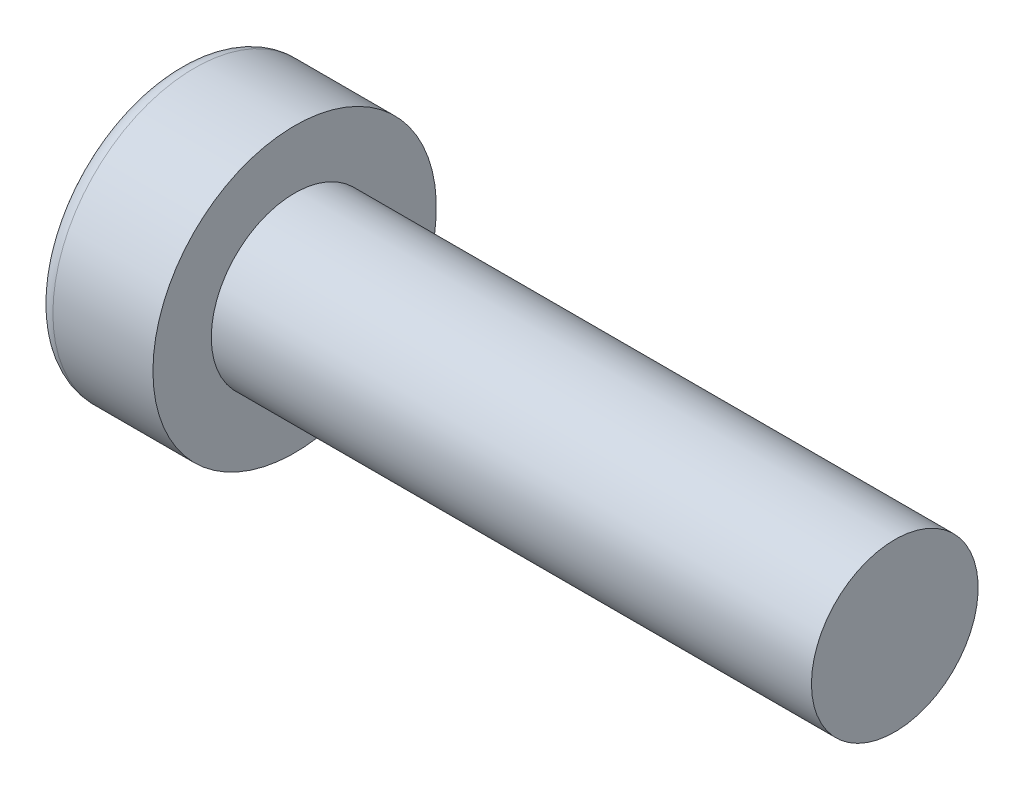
ISO-10303-21;
HEADER;
FILE_DESCRIPTION(('STEP AP214'),'2;1');
FILE_NAME('part.step','',(''),(''),'','','');
FILE_SCHEMA(('AUTOMOTIVE_DESIGN { 1 0 10303 214 1 1 1 1 }'));
ENDSEC;
DATA;
#1=APPLICATION_CONTEXT('core data for automotive mechanical design processes');
#2=APPLICATION_PROTOCOL_DEFINITION('international standard','automotive_design',2000,#1);
#3=PRODUCT_CONTEXT('',#1,'mechanical');
#4=PRODUCT('Part','Part','',(#3));
#5=PRODUCT_RELATED_PRODUCT_CATEGORY('part','',(#4));
#6=PRODUCT_DEFINITION_FORMATION('','',#4);
#7=PRODUCT_DEFINITION_CONTEXT('part definition',#1,'design');
#8=PRODUCT_DEFINITION('design','',#6,#7);
#9=PRODUCT_DEFINITION_SHAPE('','',#8);
#10=(LENGTH_UNIT() NAMED_UNIT(*) SI_UNIT(.MILLI.,.METRE.));
#11=(NAMED_UNIT(*) PLANE_ANGLE_UNIT() SI_UNIT($,.RADIAN.));
#12=(NAMED_UNIT(*) SI_UNIT($,.STERADIAN.) SOLID_ANGLE_UNIT());
#13=UNCERTAINTY_MEASURE_WITH_UNIT(LENGTH_MEASURE(1.E-05),#10,'distance_accuracy_value','');
#14=(GEOMETRIC_REPRESENTATION_CONTEXT(3) GLOBAL_UNCERTAINTY_ASSIGNED_CONTEXT((#13)) GLOBAL_UNIT_ASSIGNED_CONTEXT((#10,
#11,#12)) REPRESENTATION_CONTEXT('',''));
#15=CARTESIAN_POINT('',(0.,0.,0.));
#16=DIRECTION('',(0.,0.,1.));
#17=DIRECTION('',(1.,0.,0.));
#18=AXIS2_PLACEMENT_3D('',#15,#16,#17);
#19=CARTESIAN_POINT('',(-18.,4.25,0.));
#20=DIRECTION('',(-1.,0.,0.));
#21=DIRECTION('',(0.,0.,1.));
#22=AXIS2_PLACEMENT_3D('',#19,#20,#21);
#23=PLANE('',#22);
#24=CARTESIAN_POINT('',(-18.,0.,0.));
#25=DIRECTION('',(-1.,0.,0.));
#26=DIRECTION('',(0.,0.,1.));
#27=AXIS2_PLACEMENT_3D('',#24,#25,#26);
#28=CIRCLE('',#27,4.25);
#29=CARTESIAN_POINT('',(-18.,0.,4.25));
#30=VERTEX_POINT('',#29);
#31=EDGE_CURVE('E148',#30,#30,#28,.T.);
#32=ORIENTED_EDGE('',*,*,#31,.F.);
#33=EDGE_LOOP('',(#32));
#34=FACE_BOUND('',#33,.T.);
#35=CARTESIAN_POINT('',(-18.,0.,0.));
#36=DIRECTION('',(-1.,0.,0.));
#37=DIRECTION('',(0.,0.,1.));
#38=AXIS2_PLACEMENT_3D('',#35,#36,#37);
#39=CIRCLE('',#38,2.5);
#40=CARTESIAN_POINT('',(-18.,0.,2.5));
#41=VERTEX_POINT('',#40);
#42=EDGE_CURVE('E137',#41,#41,#39,.T.);
#43=ORIENTED_EDGE('',*,*,#42,.T.);
#44=EDGE_LOOP('',(#43));
#45=FACE_BOUND('',#44,.T.);
#46=ADVANCED_FACE('F35',(#34,#45),#23,.F.);
#47=CARTESIAN_POINT('',(-65.0118083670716,0.,0.));
#48=DIRECTION('',(-1.,0.,0.));
#49=DIRECTION('',(0.,0.,1.));
#50=AXIS2_PLACEMENT_3D('',#47,#48,#49);
#51=CYLINDRICAL_SURFACE('',#50,4.25);
#52=CARTESIAN_POINT('',(-21.,0.,0.));
#53=DIRECTION('',(1.,0.,0.));
#54=DIRECTION('',(0.,0.,-1.));
#55=AXIS2_PLACEMENT_3D('',#52,#53,#54);
#56=CIRCLE('',#55,4.25);
#57=CARTESIAN_POINT('',(-21.,0.,-4.25));
#58=VERTEX_POINT('',#57);
#59=EDGE_CURVE('E11',#58,#58,#56,.T.);
#60=ORIENTED_EDGE('',*,*,#59,.T.);
#61=EDGE_LOOP('',(#60));
#62=FACE_BOUND('',#61,.T.);
#63=ORIENTED_EDGE('',*,*,#31,.T.);
#64=EDGE_LOOP('',(#63));
#65=FACE_BOUND('',#64,.T.);
#66=ADVANCED_FACE('F170',(#62,#65),#51,.T.);
#67=CARTESIAN_POINT('',(-21.5,0.,0.));
#68=DIRECTION('',(1.,0.,0.));
#69=DIRECTION('',(0.,0.,-1.));
#70=AXIS2_PLACEMENT_3D('',#67,#68,#69);
#71=PLANE('',#70);
#72=DIRECTION('',(0.,0.5,-0.866025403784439));
#73=VECTOR('',#72,1.);
#74=CARTESIAN_POINT('',(-21.5,1.15470053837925,2.));
#75=LINE('',#74,#73);
#76=CARTESIAN_POINT('',(-21.5,1.15470053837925,2.));
#77=VERTEX_POINT('',#76);
#78=CARTESIAN_POINT('',(-21.5,2.3094010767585,0.));
#79=VERTEX_POINT('',#78);
#80=EDGE_CURVE('E124',#77,#79,#75,.T.);
#81=ORIENTED_EDGE('',*,*,#80,.F.);
#82=DIRECTION('',(0.,1.,0.));
#83=VECTOR('',#82,1.);
#84=CARTESIAN_POINT('',(-21.5,-1.15470053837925,2.));
#85=LINE('',#84,#83);
#86=CARTESIAN_POINT('',(-21.5,-1.15470053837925,2.));
#87=VERTEX_POINT('',#86);
#88=EDGE_CURVE('E50',#87,#77,#85,.T.);
#89=ORIENTED_EDGE('',*,*,#88,.F.);
#90=DIRECTION('',(0.,0.5,0.866025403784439));
#91=VECTOR('',#90,1.);
#92=CARTESIAN_POINT('',(-21.5,-2.3094010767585,0.));
#93=LINE('',#92,#91);
#94=CARTESIAN_POINT('',(-21.5,-2.3094010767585,0.));
#95=VERTEX_POINT('',#94);
#96=EDGE_CURVE('E133',#95,#87,#93,.T.);
#97=ORIENTED_EDGE('',*,*,#96,.F.);
#98=DIRECTION('',(0.,-0.5,0.866025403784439));
#99=VECTOR('',#98,1.);
#100=CARTESIAN_POINT('',(-21.5,-1.15470053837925,-2.));
#101=LINE('',#100,#99);
#102=CARTESIAN_POINT('',(-21.5,-1.15470053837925,-2.));
#103=VERTEX_POINT('',#102);
#104=EDGE_CURVE('E131',#103,#95,#101,.T.);
#105=ORIENTED_EDGE('',*,*,#104,.F.);
#106=DIRECTION('',(0.,-1.,0.));
#107=VECTOR('',#106,1.);
#108=CARTESIAN_POINT('',(-21.5,1.15470053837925,-2.));
#109=LINE('',#108,#107);
#110=CARTESIAN_POINT('',(-21.5,1.15470053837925,-2.));
#111=VERTEX_POINT('',#110);
#112=EDGE_CURVE('E98',#111,#103,#109,.T.);
#113=ORIENTED_EDGE('',*,*,#112,.F.);
#114=DIRECTION('',(0.,-0.5,-0.866025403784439));
#115=VECTOR('',#114,1.);
#116=CARTESIAN_POINT('',(-21.5,2.3094010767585,0.));
#117=LINE('',#116,#115);
#118=EDGE_CURVE('E127',#79,#111,#117,.T.);
#119=ORIENTED_EDGE('',*,*,#118,.F.);
#120=EDGE_LOOP('',(#81,#89,#97,#105,#113,#119));
#121=FACE_BOUND('',#120,.T.);
#122=CARTESIAN_POINT('',(-21.5,0.,0.));
#123=DIRECTION('',(1.,0.,0.));
#124=DIRECTION('',(0.,0.,-1.));
#125=AXIS2_PLACEMENT_3D('',#122,#123,#124);
#126=CIRCLE('',#125,3.75);
#127=CARTESIAN_POINT('',(-21.5,0.,-3.75));
#128=VERTEX_POINT('',#127);
#129=EDGE_CURVE('E43',#128,#128,#126,.F.);
#130=ORIENTED_EDGE('',*,*,#129,.T.);
#131=EDGE_LOOP('',(#130));
#132=FACE_BOUND('',#131,.T.);
#133=ADVANCED_FACE('F153',(#121,#132),#71,.F.);
#134=CARTESIAN_POINT('',(0.,2.5,0.));
#135=DIRECTION('',(-1.,0.,0.));
#136=DIRECTION('',(0.,0.,1.));
#137=AXIS2_PLACEMENT_3D('',#134,#135,#136);
#138=PLANE('',#137);
#139=CARTESIAN_POINT('',(0.,0.,0.));
#140=DIRECTION('',(-1.,0.,0.));
#141=DIRECTION('',(0.,0.,1.));
#142=AXIS2_PLACEMENT_3D('',#139,#140,#141);
#143=CIRCLE('',#142,2.5);
#144=CARTESIAN_POINT('',(0.,0.,2.5));
#145=VERTEX_POINT('',#144);
#146=EDGE_CURVE('E145',#145,#145,#143,.T.);
#147=ORIENTED_EDGE('',*,*,#146,.F.);
#148=EDGE_LOOP('',(#147));
#149=FACE_BOUND('',#148,.T.);
#150=ADVANCED_FACE('F165',(#149),#138,.F.);
#151=CARTESIAN_POINT('',(-65.0118083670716,0.,0.));
#152=DIRECTION('',(-1.,0.,0.));
#153=DIRECTION('',(0.,0.,1.));
#154=AXIS2_PLACEMENT_3D('',#151,#152,#153);
#155=CYLINDRICAL_SURFACE('',#154,2.5);
#156=ORIENTED_EDGE('',*,*,#42,.F.);
#157=EDGE_LOOP('',(#156));
#158=FACE_BOUND('',#157,.T.);
#159=ORIENTED_EDGE('',*,*,#146,.T.);
#160=EDGE_LOOP('',(#159));
#161=FACE_BOUND('',#160,.T.);
#162=ADVANCED_FACE('F157',(#158,#161),#155,.T.);
#163=CARTESIAN_POINT('',(-21.,0.,0.));
#164=DIRECTION('',(1.,0.,0.));
#165=DIRECTION('',(0.,0.,-1.));
#166=AXIS2_PLACEMENT_3D('',#163,#164,#165);
#167=TOROIDAL_SURFACE('',#166,3.75,0.5);
#168=ORIENTED_EDGE('',*,*,#59,.F.);
#169=EDGE_LOOP('',(#168));
#170=FACE_BOUND('',#169,.T.);
#171=ORIENTED_EDGE('',*,*,#129,.F.);
#172=EDGE_LOOP('',(#171));
#173=FACE_BOUND('',#172,.T.);
#174=ADVANCED_FACE('F37',(#170,#173),#167,.T.);
#175=CARTESIAN_POINT('',(-18.5,-1.15470053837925,2.));
#176=DIRECTION('',(0.,0.,1.));
#177=DIRECTION('',(1.,0.,0.));
#178=AXIS2_PLACEMENT_3D('',#175,#176,#177);
#179=PLANE('',#178);
#180=ORIENTED_EDGE('',*,*,#88,.T.);
#181=DIRECTION('',(-1.,0.,0.));
#182=VECTOR('',#181,1.);
#183=CARTESIAN_POINT('',(-18.5,1.15470053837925,2.));
#184=LINE('',#183,#182);
#185=CARTESIAN_POINT('',(-18.5,1.15470053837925,2.));
#186=VERTEX_POINT('',#185);
#187=EDGE_CURVE('E80',#186,#77,#184,.T.);
#188=ORIENTED_EDGE('',*,*,#187,.F.);
#189=DIRECTION('',(0.,1.,0.));
#190=VECTOR('',#189,1.);
#191=CARTESIAN_POINT('',(-18.5,-1.15470053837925,2.));
#192=LINE('',#191,#190);
#193=CARTESIAN_POINT('',(-18.5,-1.15470053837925,2.));
#194=VERTEX_POINT('',#193);
#195=EDGE_CURVE('E135',#194,#186,#192,.T.);
#196=ORIENTED_EDGE('',*,*,#195,.F.);
#197=DIRECTION('',(-1.,0.,0.));
#198=VECTOR('',#197,1.);
#199=CARTESIAN_POINT('',(-18.5,-1.15470053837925,2.));
#200=LINE('',#199,#198);
#201=EDGE_CURVE('E58',#194,#87,#200,.T.);
#202=ORIENTED_EDGE('',*,*,#201,.T.);
#203=EDGE_LOOP('',(#180,#188,#196,#202));
#204=FACE_BOUND('',#203,.T.);
#205=ADVANCED_FACE('F156',(#204),#179,.F.);
#206=CARTESIAN_POINT('',(-18.5,-2.3094010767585,0.));
#207=DIRECTION('',(0.,-0.866025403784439,0.5));
#208=DIRECTION('',(0.,-0.5,-0.866025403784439));
#209=AXIS2_PLACEMENT_3D('',#206,#207,#208);
#210=PLANE('',#209);
#211=ORIENTED_EDGE('',*,*,#96,.T.);
#212=ORIENTED_EDGE('',*,*,#201,.F.);
#213=DIRECTION('',(0.,0.5,0.866025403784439));
#214=VECTOR('',#213,1.);
#215=CARTESIAN_POINT('',(-18.5,-2.3094010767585,0.));
#216=LINE('',#215,#214);
#217=CARTESIAN_POINT('',(-18.5,-2.3094010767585,0.));
#218=VERTEX_POINT('',#217);
#219=EDGE_CURVE('E110',#218,#194,#216,.T.);
#220=ORIENTED_EDGE('',*,*,#219,.F.);
#221=DIRECTION('',(-1.,0.,0.));
#222=VECTOR('',#221,1.);
#223=CARTESIAN_POINT('',(-18.5,-2.3094010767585,0.));
#224=LINE('',#223,#222);
#225=EDGE_CURVE('E102',#218,#95,#224,.T.);
#226=ORIENTED_EDGE('',*,*,#225,.T.);
#227=EDGE_LOOP('',(#211,#212,#220,#226));
#228=FACE_BOUND('',#227,.T.);
#229=ADVANCED_FACE('F163',(#228),#210,.F.);
#230=CARTESIAN_POINT('',(-18.5,-1.15470053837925,-2.));
#231=DIRECTION('',(0.,-0.866025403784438,-0.5));
#232=DIRECTION('',(0.,0.5,-0.866025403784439));
#233=AXIS2_PLACEMENT_3D('',#230,#231,#232);
#234=PLANE('',#233);
#235=ORIENTED_EDGE('',*,*,#104,.T.);
#236=ORIENTED_EDGE('',*,*,#225,.F.);
#237=DIRECTION('',(0.,-0.5,0.866025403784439));
#238=VECTOR('',#237,1.);
#239=CARTESIAN_POINT('',(-18.5,-1.15470053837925,-2.));
#240=LINE('',#239,#238);
#241=CARTESIAN_POINT('',(-18.5,-1.15470053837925,-2.));
#242=VERTEX_POINT('',#241);
#243=EDGE_CURVE('E106',#242,#218,#240,.T.);
#244=ORIENTED_EDGE('',*,*,#243,.F.);
#245=DIRECTION('',(-1.,0.,0.));
#246=VECTOR('',#245,1.);
#247=CARTESIAN_POINT('',(-18.5,-1.15470053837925,-2.));
#248=LINE('',#247,#246);
#249=EDGE_CURVE('E91',#242,#103,#248,.T.);
#250=ORIENTED_EDGE('',*,*,#249,.T.);
#251=EDGE_LOOP('',(#235,#236,#244,#250));
#252=FACE_BOUND('',#251,.T.);
#253=ADVANCED_FACE('F107',(#252),#234,.F.);
#254=CARTESIAN_POINT('',(-18.5,1.15470053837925,-2.));
#255=DIRECTION('',(0.,0.,-1.));
#256=DIRECTION('',(0.,1.,0.));
#257=AXIS2_PLACEMENT_3D('',#254,#255,#256);
#258=PLANE('',#257);
#259=ORIENTED_EDGE('',*,*,#112,.T.);
#260=ORIENTED_EDGE('',*,*,#249,.F.);
#261=DIRECTION('',(0.,-1.,0.));
#262=VECTOR('',#261,1.);
#263=CARTESIAN_POINT('',(-18.5,1.15470053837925,-2.));
#264=LINE('',#263,#262);
#265=CARTESIAN_POINT('',(-18.5,1.15470053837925,-2.));
#266=VERTEX_POINT('',#265);
#267=EDGE_CURVE('E95',#266,#242,#264,.T.);
#268=ORIENTED_EDGE('',*,*,#267,.F.);
#269=DIRECTION('',(-1.,0.,0.));
#270=VECTOR('',#269,1.);
#271=CARTESIAN_POINT('',(-18.5,1.15470053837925,-2.));
#272=LINE('',#271,#270);
#273=EDGE_CURVE('E103',#266,#111,#272,.T.);
#274=ORIENTED_EDGE('',*,*,#273,.T.);
#275=EDGE_LOOP('',(#259,#260,#268,#274));
#276=FACE_BOUND('',#275,.T.);
#277=ADVANCED_FACE('F93',(#276),#258,.F.);
#278=CARTESIAN_POINT('',(-18.5,2.3094010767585,0.));
#279=DIRECTION('',(0.,0.866025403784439,-0.5));
#280=DIRECTION('',(0.,0.5,0.866025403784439));
#281=AXIS2_PLACEMENT_3D('',#278,#279,#280);
#282=PLANE('',#281);
#283=ORIENTED_EDGE('',*,*,#118,.T.);
#284=ORIENTED_EDGE('',*,*,#273,.F.);
#285=DIRECTION('',(0.,-0.5,-0.866025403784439));
#286=VECTOR('',#285,1.);
#287=CARTESIAN_POINT('',(-18.5,2.3094010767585,0.));
#288=LINE('',#287,#286);
#289=CARTESIAN_POINT('',(-18.5,2.3094010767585,0.));
#290=VERTEX_POINT('',#289);
#291=EDGE_CURVE('E116',#290,#266,#288,.T.);
#292=ORIENTED_EDGE('',*,*,#291,.F.);
#293=DIRECTION('',(-1.,0.,0.));
#294=VECTOR('',#293,1.);
#295=CARTESIAN_POINT('',(-18.5,2.3094010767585,0.));
#296=LINE('',#295,#294);
#297=EDGE_CURVE('E140',#290,#79,#296,.T.);
#298=ORIENTED_EDGE('',*,*,#297,.T.);
#299=EDGE_LOOP('',(#283,#284,#292,#298));
#300=FACE_BOUND('',#299,.T.);
#301=ADVANCED_FACE('F189',(#300),#282,.F.);
#302=CARTESIAN_POINT('',(-18.5,1.15470053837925,2.));
#303=DIRECTION('',(0.,0.866025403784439,0.5));
#304=DIRECTION('',(0.,-0.5,0.866025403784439));
#305=AXIS2_PLACEMENT_3D('',#302,#303,#304);
#306=PLANE('',#305);
#307=ORIENTED_EDGE('',*,*,#80,.T.);
#308=ORIENTED_EDGE('',*,*,#297,.F.);
#309=DIRECTION('',(0.,0.5,-0.866025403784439));
#310=VECTOR('',#309,1.);
#311=CARTESIAN_POINT('',(-18.5,1.15470053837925,2.));
#312=LINE('',#311,#310);
#313=EDGE_CURVE('E118',#186,#290,#312,.T.);
#314=ORIENTED_EDGE('',*,*,#313,.F.);
#315=ORIENTED_EDGE('',*,*,#187,.T.);
#316=EDGE_LOOP('',(#307,#308,#314,#315));
#317=FACE_BOUND('',#316,.T.);
#318=ADVANCED_FACE('F186',(#317),#306,.F.);
#319=CARTESIAN_POINT('',(-18.5,0.,0.));
#320=DIRECTION('',(-1.,0.,0.));
#321=DIRECTION('',(0.,0.,1.));
#322=AXIS2_PLACEMENT_3D('',#319,#320,#321);
#323=PLANE('',#322);
#324=ORIENTED_EDGE('',*,*,#195,.T.);
#325=ORIENTED_EDGE('',*,*,#313,.T.);
#326=ORIENTED_EDGE('',*,*,#291,.T.);
#327=ORIENTED_EDGE('',*,*,#267,.T.);
#328=ORIENTED_EDGE('',*,*,#243,.T.);
#329=ORIENTED_EDGE('',*,*,#219,.T.);
#330=EDGE_LOOP('',(#324,#325,#326,#327,#328,#329));
#331=FACE_BOUND('',#330,.T.);
#332=ADVANCED_FACE('F113',(#331),#323,.T.);
#333=CLOSED_SHELL('',(#46,#66,#133,#150,#162,#174,#205,#229,#253,#277,#301,#318,#332));
#334=MANIFOLD_SOLID_BREP('B2',#333);
#335=ADVANCED_BREP_SHAPE_REPRESENTATION('',(#18,#334),#14);
#336=SHAPE_DEFINITION_REPRESENTATION(#9,#335);
ENDSEC;
END-ISO-10303-21;
